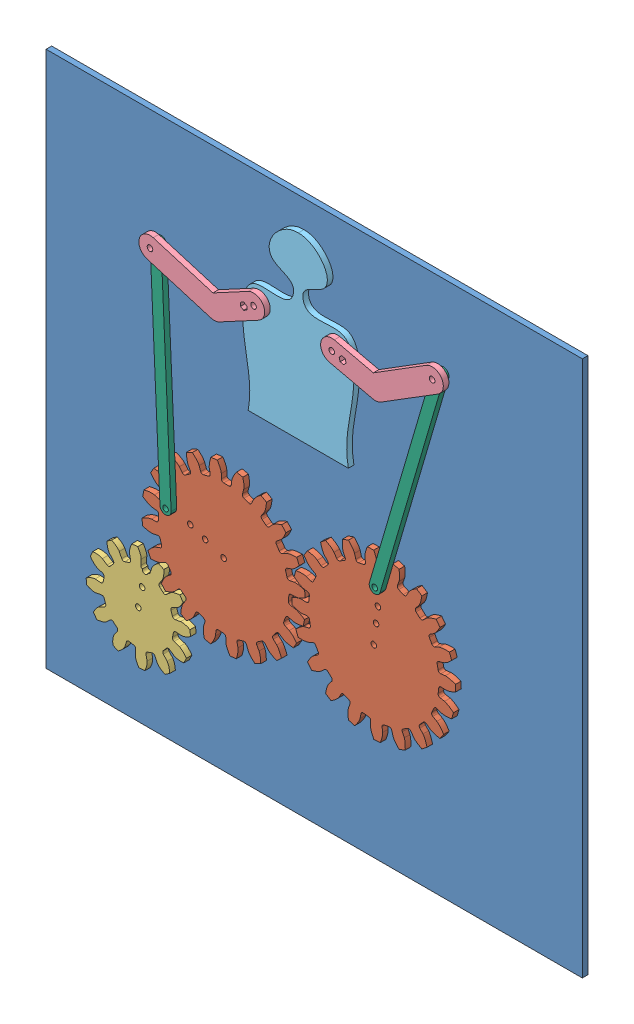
SolidWorks assembly LittleManVee.SLDASM, configuration Default (file format 9000). Lengths in mm.
Overall size (304.8 304.8 12.7).
9 component instances, 6 part files, 12 mates.
Components (placement in the parent):
- BackingPlate-1: BackingPlate.SLDPRT [Default] at (-51.5797 4.165 131.8523) size (304.8 304.8 3.17)
- SpurGear20-1: SpurGear20.SLDPRT [Default] at (52.4976 112.1385 135.0273) x (0.347637 0.937629 0) z (0 0 1) size (92.49 92.49 3.17)
- SpurGear20-2: SpurGear20.SLDPRT [Default] at (137.8416 112.1385 135.0273) x (0.993079 -0.117446 0) z (0 0 1) size (92.49 92.49 3.17)
- SpurGear12-1: SpurGear12.SLDPRT [Default] at (4.0042 63.6451 135.0273) x (0.981317 -0.192398 0) z (0 0 1) size (58.02 58.02 3.17)
- Arm-1: Arm.SLDPRT [Default] at (145.0738 245.4128 144.5523) x (-0.974156 0.225875 0) z (0 0 -1) size (65.04 39.64 3.17)
- Torso-1: Torso.SLDPRT [Default] at (98.0937 194.9557 138.2023) x (1 -0.000013 0) z (0 0 1) size (63.56 101.81 3.17)
- Arm-2: Arm.SLDPRT [Default] at (53.4917 239.1139 141.3773) x (0.880587 0.473884 0) z (0 0 1) size (65.04 39.64 3.17)
- Link-1: Link.SLDPRT [Default] at (17.0012 250.0708 138.2023) x (0.044638 -0.999003 0) z (0 0 1) size (133.35 6.35 3.17)
- Link-2: Link.SLDPRT [Default] at (177.4035 265.572 141.3773) x (-0.282093 -0.959387 0) z (0 0 -1) size (133.35 6.35 3.17)
Mates (geometry in assembly coordinates):
- Coincident1: coincident aligned: circle of BackingPlate-1; circle of SpurGear20-1
- Coincident3: coincident aligned: circle of BackingPlate-1; circle of SpurGear20-2
- GearMate1: gear = 508 mm: cylinder of SpurGear20-1 through (52.4976 112.1385 138.2023) axis (0 0 -1) radius 1.5875; cylinder of SpurGear20-2 through (137.8416 112.1385 138.2023) axis (0 0 -1) radius 1.5875
- Coincident4: coincident aligned: circle of BackingPlate-1; circle of SpurGear12-1
- GearMate2: gear = 508 mm: cylinder of SpurGear12-1 through (4.0042 63.6451 138.2023) axis (0 0 -1) radius 1.5875; cylinder of SpurGear20-1 through (52.4976 112.1385 138.2023) axis (0 0 -1) radius 1.5875
- Distance1: distance = 3.175 mm anti-aligned: plane of BackingPlate-1 through (-51.5797 4.165 135.0273) normal (0 0 1); plane of Torso-1 through (122.6224 259.3194 138.2023) normal (0 0 -1)
- Concentric1: concentric anti-aligned: circle of SpurGear20-1; circle of Link-1
- Coincident16: coincident aligned: circle of SpurGear20-2; circle of Link-2
- Coincident17: coincident aligned: circle of Torso-1; circle of Arm-2
- Coincident18: coincident aligned: circle of Arm-2; circle of Link-1
- Coincident19: coincident anti-aligned: circle of Arm-1; circle of Torso-1
- Coincident20: coincident aligned: circle of Arm-1; circle of Link-2
